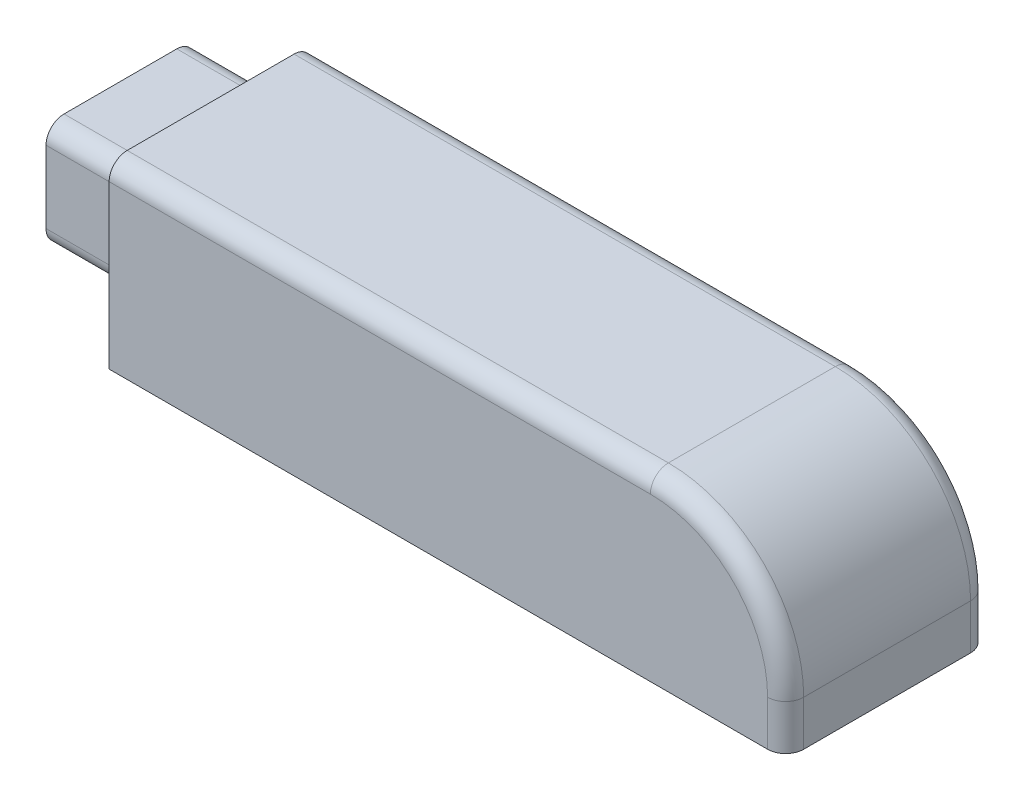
ISO-10303-21;
HEADER;
FILE_DESCRIPTION(('STEP AP214'),'2;1');
FILE_NAME('part.step','',(''),(''),'','','');
FILE_SCHEMA(('AUTOMOTIVE_DESIGN { 1 0 10303 214 1 1 1 1 }'));
ENDSEC;
DATA;
#1=APPLICATION_CONTEXT('core data for automotive mechanical design processes');
#2=APPLICATION_PROTOCOL_DEFINITION('international standard','automotive_design',2000,#1);
#3=PRODUCT_CONTEXT('',#1,'mechanical');
#4=PRODUCT('Part','Part','',(#3));
#5=PRODUCT_RELATED_PRODUCT_CATEGORY('part','',(#4));
#6=PRODUCT_DEFINITION_FORMATION('','',#4);
#7=PRODUCT_DEFINITION_CONTEXT('part definition',#1,'design');
#8=PRODUCT_DEFINITION('design','',#6,#7);
#9=PRODUCT_DEFINITION_SHAPE('','',#8);
#10=(LENGTH_UNIT() NAMED_UNIT(*) SI_UNIT(.MILLI.,.METRE.));
#11=(NAMED_UNIT(*) PLANE_ANGLE_UNIT() SI_UNIT($,.RADIAN.));
#12=(NAMED_UNIT(*) SI_UNIT($,.STERADIAN.) SOLID_ANGLE_UNIT());
#13=UNCERTAINTY_MEASURE_WITH_UNIT(LENGTH_MEASURE(1.E-05),#10,'distance_accuracy_value','');
#14=(GEOMETRIC_REPRESENTATION_CONTEXT(3) GLOBAL_UNCERTAINTY_ASSIGNED_CONTEXT((#13)) GLOBAL_UNIT_ASSIGNED_CONTEXT((#10,
#11,#12)) REPRESENTATION_CONTEXT('',''));
#15=CARTESIAN_POINT('',(0.,0.,0.));
#16=DIRECTION('',(0.,0.,1.));
#17=DIRECTION('',(1.,0.,0.));
#18=AXIS2_PLACEMENT_3D('',#15,#16,#17);
#19=CARTESIAN_POINT('',(-40.,40.,22.5));
#20=DIRECTION('',(1.,0.,0.));
#21=DIRECTION('',(0.,0.,-1.));
#22=AXIS2_PLACEMENT_3D('',#19,#20,#21);
#23=PLANE('',#22);
#24=DIRECTION('',(0.,0.,1.));
#25=VECTOR('',#24,1.);
#26=CARTESIAN_POINT('',(-40.,40.,22.5));
#27=LINE('',#26,#25);
#28=CARTESIAN_POINT('',(-40.,40.,-18.5));
#29=VERTEX_POINT('',#28);
#30=CARTESIAN_POINT('',(-40.,40.,18.5));
#31=VERTEX_POINT('',#30);
#32=EDGE_CURVE('E241',#29,#31,#27,.T.);
#33=ORIENTED_EDGE('',*,*,#32,.F.);
#34=CARTESIAN_POINT('',(-40.,36.,-18.5));
#35=DIRECTION('',(1.,0.,0.));
#36=DIRECTION('',(0.,0.,-1.));
#37=AXIS2_PLACEMENT_3D('',#34,#35,#36);
#38=CIRCLE('',#37,4.);
#39=CARTESIAN_POINT('',(-40.,36.,-22.5));
#40=VERTEX_POINT('',#39);
#41=EDGE_CURVE('E298',#29,#40,#38,.F.);
#42=ORIENTED_EDGE('',*,*,#41,.T.);
#43=DIRECTION('',(0.,-1.,0.));
#44=VECTOR('',#43,1.);
#45=CARTESIAN_POINT('',(-40.,40.,-22.5));
#46=LINE('',#45,#44);
#47=CARTESIAN_POINT('',(-40.,0.,-22.5));
#48=VERTEX_POINT('',#47);
#49=EDGE_CURVE('E244',#40,#48,#46,.T.);
#50=ORIENTED_EDGE('',*,*,#49,.T.);
#51=DIRECTION('',(0.,0.,1.));
#52=VECTOR('',#51,1.);
#53=CARTESIAN_POINT('',(-40.,0.,22.5));
#54=LINE('',#53,#52);
#55=CARTESIAN_POINT('',(-40.,0.,-8.5));
#56=VERTEX_POINT('',#55);
#57=EDGE_CURVE('E246',#48,#56,#54,.T.);
#58=ORIENTED_EDGE('',*,*,#57,.T.);
#59=DIRECTION('',(0.,-1.,0.));
#60=VECTOR('',#59,1.);
#61=CARTESIAN_POINT('',(-40.,6.,-8.5));
#62=LINE('',#61,#60);
#63=CARTESIAN_POINT('',(-40.,6.,-8.5));
#64=VERTEX_POINT('',#63);
#65=EDGE_CURVE('E216',#64,#56,#62,.T.);
#66=ORIENTED_EDGE('',*,*,#65,.F.);
#67=DIRECTION('',(0.,0.,-1.));
#68=VECTOR('',#67,1.);
#69=CARTESIAN_POINT('',(-40.,6.,8.5));
#70=LINE('',#69,#68);
#71=CARTESIAN_POINT('',(-40.,6.,8.5));
#72=VERTEX_POINT('',#71);
#73=EDGE_CURVE('E198',#72,#64,#70,.T.);
#74=ORIENTED_EDGE('',*,*,#73,.F.);
#75=DIRECTION('',(0.,-1.,0.));
#76=VECTOR('',#75,1.);
#77=CARTESIAN_POINT('',(-40.,6.,8.5));
#78=LINE('',#77,#76);
#79=CARTESIAN_POINT('',(-40.,0.,8.5));
#80=VERTEX_POINT('',#79);
#81=EDGE_CURVE('E189',#72,#80,#78,.T.);
#82=ORIENTED_EDGE('',*,*,#81,.T.);
#83=CARTESIAN_POINT('',(-40.,0.,22.5));
#84=VERTEX_POINT('',#83);
#85=EDGE_CURVE('E232',#80,#84,#54,.T.);
#86=ORIENTED_EDGE('',*,*,#85,.T.);
#87=DIRECTION('',(0.,-1.,0.));
#88=VECTOR('',#87,1.);
#89=CARTESIAN_POINT('',(-40.,40.,22.5));
#90=LINE('',#89,#88);
#91=CARTESIAN_POINT('',(-40.,36.,22.5));
#92=VERTEX_POINT('',#91);
#93=EDGE_CURVE('E258',#92,#84,#90,.T.);
#94=ORIENTED_EDGE('',*,*,#93,.F.);
#95=CARTESIAN_POINT('',(-40.,36.,18.5));
#96=DIRECTION('',(1.,0.,0.));
#97=DIRECTION('',(0.,0.,-1.));
#98=AXIS2_PLACEMENT_3D('',#95,#96,#97);
#99=CIRCLE('',#98,4.);
#100=EDGE_CURVE('E296',#92,#31,#99,.F.);
#101=ORIENTED_EDGE('',*,*,#100,.T.);
#102=EDGE_LOOP('',(#33,#42,#50,#58,#66,#74,#82,#86,#94,#101));
#103=FACE_BOUND('',#102,.T.);
#104=DIRECTION('',(0.,-1.,0.));
#105=VECTOR('',#104,1.);
#106=CARTESIAN_POINT('',(-40.,10.,16.5));
#107=LINE('',#106,#105);
#108=CARTESIAN_POINT('',(-40.,30.,16.5));
#109=VERTEX_POINT('',#108);
#110=CARTESIAN_POINT('',(-40.,14.,16.5));
#111=VERTEX_POINT('',#110);
#112=EDGE_CURVE('E236',#109,#111,#107,.T.);
#113=ORIENTED_EDGE('',*,*,#112,.T.);
#114=CARTESIAN_POINT('',(-40.,14.,12.5));
#115=DIRECTION('',(1.,0.,0.));
#116=DIRECTION('',(0.,0.,-1.));
#117=AXIS2_PLACEMENT_3D('',#114,#115,#116);
#118=CIRCLE('',#117,4.);
#119=CARTESIAN_POINT('',(-40.,10.,12.5));
#120=VERTEX_POINT('',#119);
#121=EDGE_CURVE('E340',#111,#120,#118,.T.);
#122=ORIENTED_EDGE('',*,*,#121,.T.);
#123=DIRECTION('',(0.,0.,-1.));
#124=VECTOR('',#123,1.);
#125=CARTESIAN_POINT('',(-40.,10.,16.5));
#126=LINE('',#125,#124);
#127=CARTESIAN_POINT('',(-40.,10.,-12.5));
#128=VERTEX_POINT('',#127);
#129=EDGE_CURVE('E223',#120,#128,#126,.T.);
#130=ORIENTED_EDGE('',*,*,#129,.T.);
#131=CARTESIAN_POINT('',(-40.,14.,-12.5));
#132=DIRECTION('',(1.,0.,0.));
#133=DIRECTION('',(0.,0.,-1.));
#134=AXIS2_PLACEMENT_3D('',#131,#132,#133);
#135=CIRCLE('',#134,4.);
#136=CARTESIAN_POINT('',(-40.,14.,-16.5));
#137=VERTEX_POINT('',#136);
#138=EDGE_CURVE('E338',#128,#137,#135,.T.);
#139=ORIENTED_EDGE('',*,*,#138,.T.);
#140=DIRECTION('',(0.,1.,0.));
#141=VECTOR('',#140,1.);
#142=CARTESIAN_POINT('',(-40.,10.,-16.5));
#143=LINE('',#142,#141);
#144=CARTESIAN_POINT('',(-40.,30.,-16.5));
#145=VERTEX_POINT('',#144);
#146=EDGE_CURVE('E215',#137,#145,#143,.T.);
#147=ORIENTED_EDGE('',*,*,#146,.T.);
#148=CARTESIAN_POINT('',(-40.,30.,-12.5));
#149=DIRECTION('',(1.,0.,0.));
#150=DIRECTION('',(0.,0.,-1.));
#151=AXIS2_PLACEMENT_3D('',#148,#149,#150);
#152=CIRCLE('',#151,4.);
#153=CARTESIAN_POINT('',(-40.,34.,-12.5));
#154=VERTEX_POINT('',#153);
#155=EDGE_CURVE('E45',#145,#154,#152,.T.);
#156=ORIENTED_EDGE('',*,*,#155,.T.);
#157=DIRECTION('',(0.,0.,1.));
#158=VECTOR('',#157,1.);
#159=CARTESIAN_POINT('',(-40.,34.,16.5));
#160=LINE('',#159,#158);
#161=CARTESIAN_POINT('',(-40.,34.,12.5));
#162=VERTEX_POINT('',#161);
#163=EDGE_CURVE('E234',#154,#162,#160,.T.);
#164=ORIENTED_EDGE('',*,*,#163,.T.);
#165=CARTESIAN_POINT('',(-40.,30.,12.5));
#166=DIRECTION('',(1.,0.,0.));
#167=DIRECTION('',(0.,0.,-1.));
#168=AXIS2_PLACEMENT_3D('',#165,#166,#167);
#169=CIRCLE('',#168,4.);
#170=EDGE_CURVE('E11',#162,#109,#169,.T.);
#171=ORIENTED_EDGE('',*,*,#170,.T.);
#172=EDGE_LOOP('',(#113,#122,#130,#139,#147,#156,#164,#171));
#173=FACE_BOUND('',#172,.T.);
#174=ADVANCED_FACE('F37',(#103,#173),#23,.F.);
#175=CARTESIAN_POINT('',(110.,40.,22.5));
#176=DIRECTION('',(0.,0.,-1.));
#177=DIRECTION('',(-1.,0.,0.));
#178=AXIS2_PLACEMENT_3D('',#175,#176,#177);
#179=PLANE('',#178);
#180=DIRECTION('',(1.,0.,0.));
#181=VECTOR('',#180,1.);
#182=CARTESIAN_POINT('',(110.,0.,22.5));
#183=LINE('',#182,#181);
#184=CARTESIAN_POINT('',(106.,0.,22.5));
#185=VERTEX_POINT('',#184);
#186=EDGE_CURVE('E249',#84,#185,#183,.T.);
#187=ORIENTED_EDGE('',*,*,#186,.T.);
#188=DIRECTION('',(0.,-1.,0.));
#189=VECTOR('',#188,1.);
#190=CARTESIAN_POINT('',(106.,40.,22.5));
#191=LINE('',#190,#189);
#192=CARTESIAN_POINT('',(106.,10.,22.5));
#193=VERTEX_POINT('',#192);
#194=EDGE_CURVE('E290',#185,#193,#191,.F.);
#195=ORIENTED_EDGE('',*,*,#194,.T.);
#196=CARTESIAN_POINT('',(80.,10.,22.5));
#197=DIRECTION('',(0.,0.,-1.));
#198=DIRECTION('',(-1.,0.,0.));
#199=AXIS2_PLACEMENT_3D('',#196,#197,#198);
#200=CIRCLE('',#199,26.);
#201=CARTESIAN_POINT('',(80.,36.,22.5));
#202=VERTEX_POINT('',#201);
#203=EDGE_CURVE('E288',#193,#202,#200,.F.);
#204=ORIENTED_EDGE('',*,*,#203,.T.);
#205=DIRECTION('',(1.,0.,0.));
#206=VECTOR('',#205,1.);
#207=CARTESIAN_POINT('',(-40.,36.,22.5));
#208=LINE('',#207,#206);
#209=EDGE_CURVE('E286',#202,#92,#208,.F.);
#210=ORIENTED_EDGE('',*,*,#209,.T.);
#211=ORIENTED_EDGE('',*,*,#93,.T.);
#212=EDGE_LOOP('',(#187,#195,#204,#210,#211));
#213=FACE_BOUND('',#212,.T.);
#214=ADVANCED_FACE('F387',(#213),#179,.F.);
#215=CARTESIAN_POINT('',(110.,40.,22.5));
#216=DIRECTION('',(-1.,0.,0.));
#217=DIRECTION('',(0.,0.,1.));
#218=AXIS2_PLACEMENT_3D('',#215,#216,#217);
#219=PLANE('',#218);
#220=DIRECTION('',(0.,0.,-1.));
#221=VECTOR('',#220,1.);
#222=CARTESIAN_POINT('',(110.,0.,22.5));
#223=LINE('',#222,#221);
#224=CARTESIAN_POINT('',(110.,0.,18.5));
#225=VERTEX_POINT('',#224);
#226=CARTESIAN_POINT('',(110.,0.,-18.5));
#227=VERTEX_POINT('',#226);
#228=EDGE_CURVE('E252',#225,#227,#223,.T.);
#229=ORIENTED_EDGE('',*,*,#228,.T.);
#230=DIRECTION('',(0.,-1.,0.));
#231=VECTOR('',#230,1.);
#232=CARTESIAN_POINT('',(110.,40.,-18.5));
#233=LINE('',#232,#231);
#234=CARTESIAN_POINT('',(110.,10.,-18.5));
#235=VERTEX_POINT('',#234);
#236=EDGE_CURVE('E280',#227,#235,#233,.F.);
#237=ORIENTED_EDGE('',*,*,#236,.T.);
#238=DIRECTION('',(0.,0.,-1.));
#239=VECTOR('',#238,1.);
#240=CARTESIAN_POINT('',(110.,10.,22.5));
#241=LINE('',#240,#239);
#242=CARTESIAN_POINT('',(110.,10.,18.5));
#243=VERTEX_POINT('',#242);
#244=EDGE_CURVE('E263',#235,#243,#241,.F.);
#245=ORIENTED_EDGE('',*,*,#244,.T.);
#246=DIRECTION('',(0.,-1.,0.));
#247=VECTOR('',#246,1.);
#248=CARTESIAN_POINT('',(110.,40.,18.5));
#249=LINE('',#248,#247);
#250=EDGE_CURVE('E277',#243,#225,#249,.T.);
#251=ORIENTED_EDGE('',*,*,#250,.T.);
#252=EDGE_LOOP('',(#229,#237,#245,#251));
#253=FACE_BOUND('',#252,.T.);
#254=ADVANCED_FACE('F393',(#253),#219,.F.);
#255=CARTESIAN_POINT('',(110.,40.,-22.5));
#256=DIRECTION('',(0.,0.,1.));
#257=DIRECTION('',(1.,0.,0.));
#258=AXIS2_PLACEMENT_3D('',#255,#256,#257);
#259=PLANE('',#258);
#260=CARTESIAN_POINT('',(80.,10.,-22.5));
#261=DIRECTION('',(0.,0.,1.));
#262=DIRECTION('',(1.,0.,0.));
#263=AXIS2_PLACEMENT_3D('',#260,#261,#262);
#264=CIRCLE('',#263,26.);
#265=CARTESIAN_POINT('',(80.,36.,-22.5));
#266=VERTEX_POINT('',#265);
#267=CARTESIAN_POINT('',(106.,10.,-22.5));
#268=VERTEX_POINT('',#267);
#269=EDGE_CURVE('E268',#266,#268,#264,.F.);
#270=ORIENTED_EDGE('',*,*,#269,.T.);
#271=DIRECTION('',(0.,-1.,0.));
#272=VECTOR('',#271,1.);
#273=CARTESIAN_POINT('',(106.,40.,-22.5));
#274=LINE('',#273,#272);
#275=CARTESIAN_POINT('',(106.,0.,-22.5));
#276=VERTEX_POINT('',#275);
#277=EDGE_CURVE('E270',#268,#276,#274,.T.);
#278=ORIENTED_EDGE('',*,*,#277,.T.);
#279=DIRECTION('',(-1.,0.,0.));
#280=VECTOR('',#279,1.);
#281=CARTESIAN_POINT('',(110.,0.,-22.5));
#282=LINE('',#281,#280);
#283=EDGE_CURVE('E245',#276,#48,#282,.T.);
#284=ORIENTED_EDGE('',*,*,#283,.T.);
#285=ORIENTED_EDGE('',*,*,#49,.F.);
#286=DIRECTION('',(-1.,0.,0.));
#287=VECTOR('',#286,1.);
#288=CARTESIAN_POINT('',(80.,36.,-22.5));
#289=LINE('',#288,#287);
#290=EDGE_CURVE('E266',#40,#266,#289,.F.);
#291=ORIENTED_EDGE('',*,*,#290,.T.);
#292=EDGE_LOOP('',(#270,#278,#284,#285,#291));
#293=FACE_BOUND('',#292,.T.);
#294=ADVANCED_FACE('F440',(#293),#259,.F.);
#295=CARTESIAN_POINT('',(0.,40.,0.));
#296=DIRECTION('',(0.,1.,0.));
#297=DIRECTION('',(0.,0.,1.));
#298=AXIS2_PLACEMENT_3D('',#295,#296,#297);
#299=PLANE('',#298);
#300=DIRECTION('',(0.,0.,-1.));
#301=VECTOR('',#300,1.);
#302=CARTESIAN_POINT('',(80.,40.,-22.5));
#303=LINE('',#302,#301);
#304=CARTESIAN_POINT('',(80.,40.,18.5));
#305=VERTEX_POINT('',#304);
#306=CARTESIAN_POINT('',(80.,40.,-18.5));
#307=VERTEX_POINT('',#306);
#308=EDGE_CURVE('E260',#305,#307,#303,.T.);
#309=ORIENTED_EDGE('',*,*,#308,.T.);
#310=DIRECTION('',(-1.,0.,0.));
#311=VECTOR('',#310,1.);
#312=CARTESIAN_POINT('',(-40.,40.,-18.5));
#313=LINE('',#312,#311);
#314=EDGE_CURVE('E294',#307,#29,#313,.T.);
#315=ORIENTED_EDGE('',*,*,#314,.T.);
#316=ORIENTED_EDGE('',*,*,#32,.T.);
#317=DIRECTION('',(1.,0.,0.));
#318=VECTOR('',#317,1.);
#319=CARTESIAN_POINT('',(80.,40.,18.5));
#320=LINE('',#319,#318);
#321=EDGE_CURVE('E292',#31,#305,#320,.T.);
#322=ORIENTED_EDGE('',*,*,#321,.T.);
#323=EDGE_LOOP('',(#309,#315,#316,#322));
#324=FACE_BOUND('',#323,.T.);
#325=ADVANCED_FACE('F430',(#324),#299,.T.);
#326=CARTESIAN_POINT('',(0.,0.,0.));
#327=DIRECTION('',(0.,1.,0.));
#328=DIRECTION('',(0.,0.,1.));
#329=AXIS2_PLACEMENT_3D('',#326,#327,#328);
#330=PLANE('',#329);
#331=ORIENTED_EDGE('',*,*,#283,.F.);
#332=CARTESIAN_POINT('',(106.,0.,-18.5));
#333=DIRECTION('',(0.,1.,0.));
#334=DIRECTION('',(0.,0.,1.));
#335=AXIS2_PLACEMENT_3D('',#332,#333,#334);
#336=CIRCLE('',#335,4.);
#337=EDGE_CURVE('E275',#276,#227,#336,.F.);
#338=ORIENTED_EDGE('',*,*,#337,.T.);
#339=ORIENTED_EDGE('',*,*,#228,.F.);
#340=CARTESIAN_POINT('',(106.,0.,18.5));
#341=DIRECTION('',(0.,1.,0.));
#342=DIRECTION('',(0.,0.,1.));
#343=AXIS2_PLACEMENT_3D('',#340,#341,#342);
#344=CIRCLE('',#343,4.);
#345=EDGE_CURVE('E273',#225,#185,#344,.F.);
#346=ORIENTED_EDGE('',*,*,#345,.T.);
#347=ORIENTED_EDGE('',*,*,#186,.F.);
#348=ORIENTED_EDGE('',*,*,#85,.F.);
#349=DIRECTION('',(-1.,0.,0.));
#350=VECTOR('',#349,1.);
#351=CARTESIAN_POINT('',(-40.,0.,8.5));
#352=LINE('',#351,#350);
#353=CARTESIAN_POINT('',(90.,0.,8.5));
#354=VERTEX_POINT('',#353);
#355=EDGE_CURVE('E205',#354,#80,#352,.T.);
#356=ORIENTED_EDGE('',*,*,#355,.F.);
#357=DIRECTION('',(0.,0.,1.));
#358=VECTOR('',#357,1.);
#359=CARTESIAN_POINT('',(90.,0.,8.5));
#360=LINE('',#359,#358);
#361=CARTESIAN_POINT('',(90.,0.,-8.5));
#362=VERTEX_POINT('',#361);
#363=EDGE_CURVE('E186',#362,#354,#360,.T.);
#364=ORIENTED_EDGE('',*,*,#363,.F.);
#365=DIRECTION('',(1.,0.,0.));
#366=VECTOR('',#365,1.);
#367=CARTESIAN_POINT('',(-40.,0.,-8.5));
#368=LINE('',#367,#366);
#369=EDGE_CURVE('E202',#56,#362,#368,.T.);
#370=ORIENTED_EDGE('',*,*,#369,.F.);
#371=ORIENTED_EDGE('',*,*,#57,.F.);
#372=EDGE_LOOP('',(#331,#338,#339,#346,#347,#348,#356,#364,#370,#371));
#373=FACE_BOUND('',#372,.T.);
#374=ADVANCED_FACE('F447',(#373),#330,.F.);
#375=CARTESIAN_POINT('',(-60.,10.,-16.5));
#376=DIRECTION('',(0.,0.,-1.));
#377=DIRECTION('',(-1.,0.,0.));
#378=AXIS2_PLACEMENT_3D('',#375,#376,#377);
#379=PLANE('',#378);
#380=ORIENTED_EDGE('',*,*,#146,.F.);
#381=DIRECTION('',(1.,0.,0.));
#382=VECTOR('',#381,1.);
#383=CARTESIAN_POINT('',(-60.,14.,-16.5));
#384=LINE('',#383,#382);
#385=CARTESIAN_POINT('',(-60.,14.,-16.5));
#386=VERTEX_POINT('',#385);
#387=EDGE_CURVE('E319',#137,#386,#384,.F.);
#388=ORIENTED_EDGE('',*,*,#387,.T.);
#389=DIRECTION('',(0.,1.,0.));
#390=VECTOR('',#389,1.);
#391=CARTESIAN_POINT('',(-60.,10.,-16.5));
#392=LINE('',#391,#390);
#393=CARTESIAN_POINT('',(-60.,30.,-16.5));
#394=VERTEX_POINT('',#393);
#395=EDGE_CURVE('E219',#386,#394,#392,.T.);
#396=ORIENTED_EDGE('',*,*,#395,.T.);
#397=DIRECTION('',(1.,0.,0.));
#398=VECTOR('',#397,1.);
#399=CARTESIAN_POINT('',(-60.,30.,-16.5));
#400=LINE('',#399,#398);
#401=EDGE_CURVE('E316',#394,#145,#400,.T.);
#402=ORIENTED_EDGE('',*,*,#401,.T.);
#403=EDGE_LOOP('',(#380,#388,#396,#402));
#404=FACE_BOUND('',#403,.T.);
#405=ADVANCED_FACE('F370',(#404),#379,.T.);
#406=CARTESIAN_POINT('',(-60.,10.,16.5));
#407=DIRECTION('',(0.,-1.,0.));
#408=DIRECTION('',(0.,0.,-1.));
#409=AXIS2_PLACEMENT_3D('',#406,#407,#408);
#410=PLANE('',#409);
#411=DIRECTION('',(0.,0.,-1.));
#412=VECTOR('',#411,1.);
#413=CARTESIAN_POINT('',(-60.,10.,16.5));
#414=LINE('',#413,#412);
#415=CARTESIAN_POINT('',(-60.,10.,12.5));
#416=VERTEX_POINT('',#415);
#417=CARTESIAN_POINT('',(-60.,10.,-12.5));
#418=VERTEX_POINT('',#417);
#419=EDGE_CURVE('E229',#416,#418,#414,.T.);
#420=ORIENTED_EDGE('',*,*,#419,.T.);
#421=DIRECTION('',(1.,0.,0.));
#422=VECTOR('',#421,1.);
#423=CARTESIAN_POINT('',(-60.,10.,-12.5));
#424=LINE('',#423,#422);
#425=EDGE_CURVE('E313',#418,#128,#424,.T.);
#426=ORIENTED_EDGE('',*,*,#425,.T.);
#427=ORIENTED_EDGE('',*,*,#129,.F.);
#428=DIRECTION('',(1.,0.,0.));
#429=VECTOR('',#428,1.);
#430=CARTESIAN_POINT('',(-60.,10.,12.5));
#431=LINE('',#430,#429);
#432=EDGE_CURVE('E300',#120,#416,#431,.F.);
#433=ORIENTED_EDGE('',*,*,#432,.T.);
#434=EDGE_LOOP('',(#420,#426,#427,#433));
#435=FACE_BOUND('',#434,.T.);
#436=ADVANCED_FACE('F347',(#435),#410,.T.);
#437=CARTESIAN_POINT('',(-60.,10.,16.5));
#438=DIRECTION('',(0.,0.,1.));
#439=DIRECTION('',(1.,0.,0.));
#440=AXIS2_PLACEMENT_3D('',#437,#438,#439);
#441=PLANE('',#440);
#442=DIRECTION('',(0.,-1.,0.));
#443=VECTOR('',#442,1.);
#444=CARTESIAN_POINT('',(-60.,10.,16.5));
#445=LINE('',#444,#443);
#446=CARTESIAN_POINT('',(-60.,30.,16.5));
#447=VERTEX_POINT('',#446);
#448=CARTESIAN_POINT('',(-60.,14.,16.5));
#449=VERTEX_POINT('',#448);
#450=EDGE_CURVE('E226',#447,#449,#445,.T.);
#451=ORIENTED_EDGE('',*,*,#450,.T.);
#452=DIRECTION('',(1.,0.,0.));
#453=VECTOR('',#452,1.);
#454=CARTESIAN_POINT('',(-60.,14.,16.5));
#455=LINE('',#454,#453);
#456=EDGE_CURVE('E331',#449,#111,#455,.T.);
#457=ORIENTED_EDGE('',*,*,#456,.T.);
#458=ORIENTED_EDGE('',*,*,#112,.F.);
#459=DIRECTION('',(1.,0.,0.));
#460=VECTOR('',#459,1.);
#461=CARTESIAN_POINT('',(-60.,30.,16.5));
#462=LINE('',#461,#460);
#463=EDGE_CURVE('E329',#109,#447,#462,.F.);
#464=ORIENTED_EDGE('',*,*,#463,.T.);
#465=EDGE_LOOP('',(#451,#457,#458,#464));
#466=FACE_BOUND('',#465,.T.);
#467=ADVANCED_FACE('F358',(#466),#441,.T.);
#468=CARTESIAN_POINT('',(-60.,34.,16.5));
#469=DIRECTION('',(0.,1.,0.));
#470=DIRECTION('',(0.,0.,1.));
#471=AXIS2_PLACEMENT_3D('',#468,#469,#470);
#472=PLANE('',#471);
#473=ORIENTED_EDGE('',*,*,#163,.F.);
#474=DIRECTION('',(1.,0.,0.));
#475=VECTOR('',#474,1.);
#476=CARTESIAN_POINT('',(-60.,34.,-12.5));
#477=LINE('',#476,#475);
#478=CARTESIAN_POINT('',(-60.,34.,-12.5));
#479=VERTEX_POINT('',#478);
#480=EDGE_CURVE('E336',#154,#479,#477,.F.);
#481=ORIENTED_EDGE('',*,*,#480,.T.);
#482=DIRECTION('',(0.,0.,1.));
#483=VECTOR('',#482,1.);
#484=CARTESIAN_POINT('',(-60.,34.,16.5));
#485=LINE('',#484,#483);
#486=CARTESIAN_POINT('',(-60.,34.,12.5));
#487=VERTEX_POINT('',#486);
#488=EDGE_CURVE('E222',#479,#487,#485,.T.);
#489=ORIENTED_EDGE('',*,*,#488,.T.);
#490=DIRECTION('',(1.,0.,0.));
#491=VECTOR('',#490,1.);
#492=CARTESIAN_POINT('',(-60.,34.,12.5));
#493=LINE('',#492,#491);
#494=EDGE_CURVE('E334',#487,#162,#493,.T.);
#495=ORIENTED_EDGE('',*,*,#494,.T.);
#496=EDGE_LOOP('',(#473,#481,#489,#495));
#497=FACE_BOUND('',#496,.T.);
#498=ADVANCED_FACE('F362',(#497),#472,.T.);
#499=CARTESIAN_POINT('',(-60.,0.,0.));
#500=DIRECTION('',(-1.,0.,0.));
#501=DIRECTION('',(0.,0.,1.));
#502=AXIS2_PLACEMENT_3D('',#499,#500,#501);
#503=PLANE('',#502);
#504=ORIENTED_EDGE('',*,*,#395,.F.);
#505=CARTESIAN_POINT('',(-60.,14.,-12.5));
#506=DIRECTION('',(-1.,0.,0.));
#507=DIRECTION('',(0.,0.,1.));
#508=AXIS2_PLACEMENT_3D('',#505,#506,#507);
#509=CIRCLE('',#508,4.);
#510=EDGE_CURVE('E327',#386,#418,#509,.T.);
#511=ORIENTED_EDGE('',*,*,#510,.T.);
#512=ORIENTED_EDGE('',*,*,#419,.F.);
#513=CARTESIAN_POINT('',(-60.,14.,12.5));
#514=DIRECTION('',(-1.,0.,0.));
#515=DIRECTION('',(0.,0.,1.));
#516=AXIS2_PLACEMENT_3D('',#513,#514,#515);
#517=CIRCLE('',#516,4.);
#518=EDGE_CURVE('E325',#416,#449,#517,.T.);
#519=ORIENTED_EDGE('',*,*,#518,.T.);
#520=ORIENTED_EDGE('',*,*,#450,.F.);
#521=CARTESIAN_POINT('',(-60.,30.,12.5));
#522=DIRECTION('',(-1.,0.,0.));
#523=DIRECTION('',(0.,0.,1.));
#524=AXIS2_PLACEMENT_3D('',#521,#522,#523);
#525=CIRCLE('',#524,4.);
#526=EDGE_CURVE('E321',#447,#487,#525,.T.);
#527=ORIENTED_EDGE('',*,*,#526,.T.);
#528=ORIENTED_EDGE('',*,*,#488,.F.);
#529=CARTESIAN_POINT('',(-60.,30.,-12.5));
#530=DIRECTION('',(-1.,0.,0.));
#531=DIRECTION('',(0.,0.,1.));
#532=AXIS2_PLACEMENT_3D('',#529,#530,#531);
#533=CIRCLE('',#532,4.);
#534=EDGE_CURVE('E323',#479,#394,#533,.T.);
#535=ORIENTED_EDGE('',*,*,#534,.T.);
#536=EDGE_LOOP('',(#504,#511,#512,#519,#520,#527,#528,#535));
#537=FACE_BOUND('',#536,.T.);
#538=ADVANCED_FACE('F355',(#537),#503,.T.);
#539=CARTESIAN_POINT('',(90.,6.,8.5));
#540=DIRECTION('',(1.,0.,0.));
#541=DIRECTION('',(0.,0.,-1.));
#542=AXIS2_PLACEMENT_3D('',#539,#540,#541);
#543=PLANE('',#542);
#544=ORIENTED_EDGE('',*,*,#363,.T.);
#545=DIRECTION('',(0.,-1.,0.));
#546=VECTOR('',#545,1.);
#547=CARTESIAN_POINT('',(90.,6.,8.5));
#548=LINE('',#547,#546);
#549=CARTESIAN_POINT('',(90.,6.,8.5));
#550=VERTEX_POINT('',#549);
#551=EDGE_CURVE('E179',#550,#354,#548,.T.);
#552=ORIENTED_EDGE('',*,*,#551,.F.);
#553=DIRECTION('',(0.,0.,1.));
#554=VECTOR('',#553,1.);
#555=CARTESIAN_POINT('',(90.,6.,8.5));
#556=LINE('',#555,#554);
#557=CARTESIAN_POINT('',(90.,6.,-8.5));
#558=VERTEX_POINT('',#557);
#559=EDGE_CURVE('E183',#558,#550,#556,.T.);
#560=ORIENTED_EDGE('',*,*,#559,.F.);
#561=DIRECTION('',(0.,-1.,0.));
#562=VECTOR('',#561,1.);
#563=CARTESIAN_POINT('',(90.,6.,-8.5));
#564=LINE('',#563,#562);
#565=EDGE_CURVE('E213',#558,#362,#564,.T.);
#566=ORIENTED_EDGE('',*,*,#565,.T.);
#567=EDGE_LOOP('',(#544,#552,#560,#566));
#568=FACE_BOUND('',#567,.T.);
#569=ADVANCED_FACE('F181',(#568),#543,.F.);
#570=CARTESIAN_POINT('',(-40.,6.,-8.5));
#571=DIRECTION('',(0.,0.,-1.));
#572=DIRECTION('',(-1.,0.,0.));
#573=AXIS2_PLACEMENT_3D('',#570,#571,#572);
#574=PLANE('',#573);
#575=ORIENTED_EDGE('',*,*,#369,.T.);
#576=ORIENTED_EDGE('',*,*,#565,.F.);
#577=DIRECTION('',(1.,0.,0.));
#578=VECTOR('',#577,1.);
#579=CARTESIAN_POINT('',(-40.,6.,-8.5));
#580=LINE('',#579,#578);
#581=EDGE_CURVE('E190',#64,#558,#580,.T.);
#582=ORIENTED_EDGE('',*,*,#581,.F.);
#583=ORIENTED_EDGE('',*,*,#65,.T.);
#584=EDGE_LOOP('',(#575,#576,#582,#583));
#585=FACE_BOUND('',#584,.T.);
#586=ADVANCED_FACE('F449',(#585),#574,.F.);
#587=CARTESIAN_POINT('',(-40.,6.,8.5));
#588=DIRECTION('',(0.,0.,1.));
#589=DIRECTION('',(1.,0.,0.));
#590=AXIS2_PLACEMENT_3D('',#587,#588,#589);
#591=PLANE('',#590);
#592=ORIENTED_EDGE('',*,*,#355,.T.);
#593=ORIENTED_EDGE('',*,*,#81,.F.);
#594=DIRECTION('',(-1.,0.,0.));
#595=VECTOR('',#594,1.);
#596=CARTESIAN_POINT('',(-40.,6.,8.5));
#597=LINE('',#596,#595);
#598=EDGE_CURVE('E193',#550,#72,#597,.T.);
#599=ORIENTED_EDGE('',*,*,#598,.F.);
#600=ORIENTED_EDGE('',*,*,#551,.T.);
#601=EDGE_LOOP('',(#592,#593,#599,#600));
#602=FACE_BOUND('',#601,.T.);
#603=ADVANCED_FACE('F194',(#602),#591,.F.);
#604=CARTESIAN_POINT('',(0.,6.,0.));
#605=DIRECTION('',(0.,-1.,0.));
#606=DIRECTION('',(0.,0.,-1.));
#607=AXIS2_PLACEMENT_3D('',#604,#605,#606);
#608=PLANE('',#607);
#609=ORIENTED_EDGE('',*,*,#559,.T.);
#610=ORIENTED_EDGE('',*,*,#598,.T.);
#611=ORIENTED_EDGE('',*,*,#73,.T.);
#612=ORIENTED_EDGE('',*,*,#581,.T.);
#613=EDGE_LOOP('',(#609,#610,#611,#612));
#614=FACE_BOUND('',#613,.T.);
#615=ADVANCED_FACE('F200',(#614),#608,.T.);
#616=CARTESIAN_POINT('',(80.,10.,0.));
#617=DIRECTION('',(0.,0.,1.));
#618=DIRECTION('',(1.,0.,0.));
#619=AXIS2_PLACEMENT_3D('',#616,#617,#618);
#620=CYLINDRICAL_SURFACE('',#619,30.);
#621=ORIENTED_EDGE('',*,*,#244,.F.);
#622=CARTESIAN_POINT('',(80.,10.,-18.5));
#623=DIRECTION('',(0.,0.,1.));
#624=DIRECTION('',(1.,0.,0.));
#625=AXIS2_PLACEMENT_3D('',#622,#623,#624);
#626=CIRCLE('',#625,30.);
#627=EDGE_CURVE('E284',#235,#307,#626,.T.);
#628=ORIENTED_EDGE('',*,*,#627,.T.);
#629=ORIENTED_EDGE('',*,*,#308,.F.);
#630=CARTESIAN_POINT('',(80.,10.,18.5));
#631=DIRECTION('',(0.,0.,-1.));
#632=DIRECTION('',(-1.,0.,0.));
#633=AXIS2_PLACEMENT_3D('',#630,#631,#632);
#634=CIRCLE('',#633,30.);
#635=EDGE_CURVE('E282',#305,#243,#634,.T.);
#636=ORIENTED_EDGE('',*,*,#635,.T.);
#637=EDGE_LOOP('',(#621,#628,#629,#636));
#638=FACE_BOUND('',#637,.T.);
#639=ADVANCED_FACE('F399',(#638),#620,.T.);
#640=CARTESIAN_POINT('',(0.,36.,-18.5));
#641=DIRECTION('',(1.,0.,0.));
#642=DIRECTION('',(0.,0.,-1.));
#643=AXIS2_PLACEMENT_3D('',#640,#641,#642);
#644=CYLINDRICAL_SURFACE('',#643,4.);
#645=ORIENTED_EDGE('',*,*,#41,.F.);
#646=ORIENTED_EDGE('',*,*,#314,.F.);
#647=CARTESIAN_POINT('',(80.,36.,-18.5));
#648=DIRECTION('',(1.,0.,0.));
#649=DIRECTION('',(0.,0.,-1.));
#650=AXIS2_PLACEMENT_3D('',#647,#648,#649);
#651=CIRCLE('',#650,4.);
#652=EDGE_CURVE('E211',#266,#307,#651,.T.);
#653=ORIENTED_EDGE('',*,*,#652,.F.);
#654=ORIENTED_EDGE('',*,*,#290,.F.);
#655=EDGE_LOOP('',(#645,#646,#653,#654));
#656=FACE_BOUND('',#655,.T.);
#657=ADVANCED_FACE('F402',(#656),#644,.T.);
#658=CARTESIAN_POINT('',(80.,10.,-18.5));
#659=DIRECTION('',(0.,0.,1.));
#660=DIRECTION('',(1.,0.,0.));
#661=AXIS2_PLACEMENT_3D('',#658,#659,#660);
#662=TOROIDAL_SURFACE('',#661,26.,4.);
#663=ORIENTED_EDGE('',*,*,#652,.T.);
#664=ORIENTED_EDGE('',*,*,#627,.F.);
#665=CARTESIAN_POINT('',(106.,10.,-18.5));
#666=DIRECTION('',(0.,-1.,0.));
#667=DIRECTION('',(0.,0.,-1.));
#668=AXIS2_PLACEMENT_3D('',#665,#666,#667);
#669=CIRCLE('',#668,4.);
#670=EDGE_CURVE('E301',#268,#235,#669,.T.);
#671=ORIENTED_EDGE('',*,*,#670,.F.);
#672=ORIENTED_EDGE('',*,*,#269,.F.);
#673=EDGE_LOOP('',(#663,#664,#671,#672));
#674=FACE_BOUND('',#673,.T.);
#675=ADVANCED_FACE('F408',(#674),#662,.T.);
#676=CARTESIAN_POINT('',(106.,40.,-18.5));
#677=DIRECTION('',(0.,-1.,0.));
#678=DIRECTION('',(0.,0.,-1.));
#679=AXIS2_PLACEMENT_3D('',#676,#677,#678);
#680=CYLINDRICAL_SURFACE('',#679,4.);
#681=ORIENTED_EDGE('',*,*,#670,.T.);
#682=ORIENTED_EDGE('',*,*,#236,.F.);
#683=ORIENTED_EDGE('',*,*,#337,.F.);
#684=ORIENTED_EDGE('',*,*,#277,.F.);
#685=EDGE_LOOP('',(#681,#682,#683,#684));
#686=FACE_BOUND('',#685,.T.);
#687=ADVANCED_FACE('F404',(#686),#680,.T.);
#688=CARTESIAN_POINT('',(0.,36.,18.5));
#689=DIRECTION('',(-1.,0.,0.));
#690=DIRECTION('',(0.,0.,1.));
#691=AXIS2_PLACEMENT_3D('',#688,#689,#690);
#692=CYLINDRICAL_SURFACE('',#691,4.);
#693=ORIENTED_EDGE('',*,*,#100,.F.);
#694=ORIENTED_EDGE('',*,*,#209,.F.);
#695=CARTESIAN_POINT('',(80.,36.,18.5));
#696=DIRECTION('',(1.,0.,0.));
#697=DIRECTION('',(0.,0.,-1.));
#698=AXIS2_PLACEMENT_3D('',#695,#696,#697);
#699=CIRCLE('',#698,4.);
#700=EDGE_CURVE('E304',#305,#202,#699,.T.);
#701=ORIENTED_EDGE('',*,*,#700,.F.);
#702=ORIENTED_EDGE('',*,*,#321,.F.);
#703=EDGE_LOOP('',(#693,#694,#701,#702));
#704=FACE_BOUND('',#703,.T.);
#705=ADVANCED_FACE('F407',(#704),#692,.T.);
#706=CARTESIAN_POINT('',(80.,10.,18.5));
#707=DIRECTION('',(0.,0.,-1.));
#708=DIRECTION('',(-1.,0.,0.));
#709=AXIS2_PLACEMENT_3D('',#706,#707,#708);
#710=TOROIDAL_SURFACE('',#709,26.,4.);
#711=ORIENTED_EDGE('',*,*,#700,.T.);
#712=ORIENTED_EDGE('',*,*,#203,.F.);
#713=CARTESIAN_POINT('',(106.,10.,18.5));
#714=DIRECTION('',(0.,-1.,0.));
#715=DIRECTION('',(0.,0.,-1.));
#716=AXIS2_PLACEMENT_3D('',#713,#714,#715);
#717=CIRCLE('',#716,4.);
#718=EDGE_CURVE('E307',#243,#193,#717,.T.);
#719=ORIENTED_EDGE('',*,*,#718,.F.);
#720=ORIENTED_EDGE('',*,*,#635,.F.);
#721=EDGE_LOOP('',(#711,#712,#719,#720));
#722=FACE_BOUND('',#721,.T.);
#723=ADVANCED_FACE('F382',(#722),#710,.T.);
#724=CARTESIAN_POINT('',(106.,40.,18.5));
#725=DIRECTION('',(0.,-1.,0.));
#726=DIRECTION('',(0.,0.,-1.));
#727=AXIS2_PLACEMENT_3D('',#724,#725,#726);
#728=CYLINDRICAL_SURFACE('',#727,4.);
#729=ORIENTED_EDGE('',*,*,#718,.T.);
#730=ORIENTED_EDGE('',*,*,#194,.F.);
#731=ORIENTED_EDGE('',*,*,#345,.F.);
#732=ORIENTED_EDGE('',*,*,#250,.F.);
#733=EDGE_LOOP('',(#729,#730,#731,#732));
#734=FACE_BOUND('',#733,.T.);
#735=ADVANCED_FACE('F375',(#734),#728,.T.);
#736=CARTESIAN_POINT('',(-60.,14.,-12.5));
#737=DIRECTION('',(1.,0.,0.));
#738=DIRECTION('',(0.,0.,-1.));
#739=AXIS2_PLACEMENT_3D('',#736,#737,#738);
#740=CYLINDRICAL_SURFACE('',#739,4.);
#741=ORIENTED_EDGE('',*,*,#510,.F.);
#742=ORIENTED_EDGE('',*,*,#387,.F.);
#743=ORIENTED_EDGE('',*,*,#138,.F.);
#744=ORIENTED_EDGE('',*,*,#425,.F.);
#745=EDGE_LOOP('',(#741,#742,#743,#744));
#746=FACE_BOUND('',#745,.T.);
#747=ADVANCED_FACE('F373',(#746),#740,.T.);
#748=CARTESIAN_POINT('',(-60.,14.,12.5));
#749=DIRECTION('',(1.,0.,0.));
#750=DIRECTION('',(0.,0.,-1.));
#751=AXIS2_PLACEMENT_3D('',#748,#749,#750);
#752=CYLINDRICAL_SURFACE('',#751,4.);
#753=ORIENTED_EDGE('',*,*,#518,.F.);
#754=ORIENTED_EDGE('',*,*,#432,.F.);
#755=ORIENTED_EDGE('',*,*,#121,.F.);
#756=ORIENTED_EDGE('',*,*,#456,.F.);
#757=EDGE_LOOP('',(#753,#754,#755,#756));
#758=FACE_BOUND('',#757,.T.);
#759=ADVANCED_FACE('F351',(#758),#752,.T.);
#760=CARTESIAN_POINT('',(-60.,30.,-12.5));
#761=DIRECTION('',(1.,0.,0.));
#762=DIRECTION('',(0.,0.,-1.));
#763=AXIS2_PLACEMENT_3D('',#760,#761,#762);
#764=CYLINDRICAL_SURFACE('',#763,4.);
#765=ORIENTED_EDGE('',*,*,#534,.F.);
#766=ORIENTED_EDGE('',*,*,#480,.F.);
#767=ORIENTED_EDGE('',*,*,#155,.F.);
#768=ORIENTED_EDGE('',*,*,#401,.F.);
#769=EDGE_LOOP('',(#765,#766,#767,#768));
#770=FACE_BOUND('',#769,.T.);
#771=ADVANCED_FACE('F365',(#770),#764,.T.);
#772=CARTESIAN_POINT('',(-60.,30.,12.5));
#773=DIRECTION('',(1.,0.,0.));
#774=DIRECTION('',(0.,0.,-1.));
#775=AXIS2_PLACEMENT_3D('',#772,#773,#774);
#776=CYLINDRICAL_SURFACE('',#775,4.);
#777=ORIENTED_EDGE('',*,*,#526,.F.);
#778=ORIENTED_EDGE('',*,*,#463,.F.);
#779=ORIENTED_EDGE('',*,*,#170,.F.);
#780=ORIENTED_EDGE('',*,*,#494,.F.);
#781=EDGE_LOOP('',(#777,#778,#779,#780));
#782=FACE_BOUND('',#781,.T.);
#783=ADVANCED_FACE('F39',(#782),#776,.T.);
#784=CLOSED_SHELL('',(#174,#214,#254,#294,#325,#374,#405,#436,#467,#498,#538,#569,#586,#603,
#615,#639,#657,#675,#687,#705,#723,#735,#747,#759,#771,#783));
#785=MANIFOLD_SOLID_BREP('B2',#784);
#786=ADVANCED_BREP_SHAPE_REPRESENTATION('',(#18,#785),#14);
#787=SHAPE_DEFINITION_REPRESENTATION(#9,#786);
ENDSEC;
END-ISO-10303-21;
